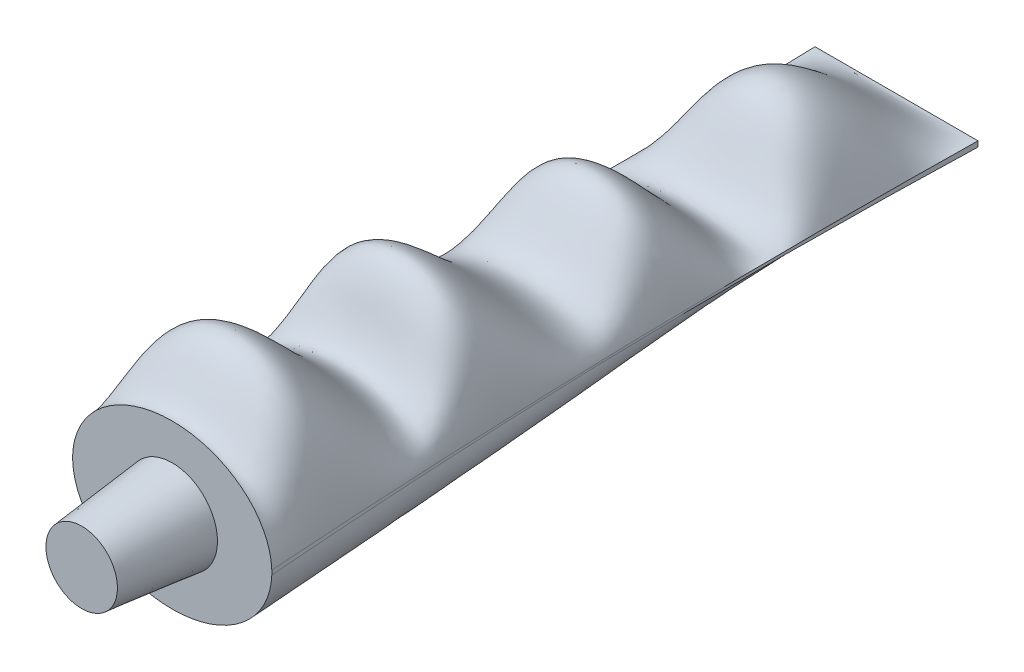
ISO-10303-21;
HEADER;
FILE_DESCRIPTION(('STEP AP214'),'2;1');
FILE_NAME('part.step','',(''),(''),'','','');
FILE_SCHEMA(('AUTOMOTIVE_DESIGN { 1 0 10303 214 1 1 1 1 }'));
ENDSEC;
DATA;
#1=APPLICATION_CONTEXT('core data for automotive mechanical design processes');
#2=APPLICATION_PROTOCOL_DEFINITION('international standard','automotive_design',2000,#1);
#3=PRODUCT_CONTEXT('',#1,'mechanical');
#4=PRODUCT('Part','Part','',(#3));
#5=PRODUCT_RELATED_PRODUCT_CATEGORY('part','',(#4));
#6=PRODUCT_DEFINITION_FORMATION('','',#4);
#7=PRODUCT_DEFINITION_CONTEXT('part definition',#1,'design');
#8=PRODUCT_DEFINITION('design','',#6,#7);
#9=PRODUCT_DEFINITION_SHAPE('','',#8);
#10=(LENGTH_UNIT() NAMED_UNIT(*) SI_UNIT(.MILLI.,.METRE.));
#11=(NAMED_UNIT(*) PLANE_ANGLE_UNIT() SI_UNIT($,.RADIAN.));
#12=(NAMED_UNIT(*) SI_UNIT($,.STERADIAN.) SOLID_ANGLE_UNIT());
#13=UNCERTAINTY_MEASURE_WITH_UNIT(LENGTH_MEASURE(1.E-05),#10,'distance_accuracy_value','');
#14=(GEOMETRIC_REPRESENTATION_CONTEXT(3) GLOBAL_UNCERTAINTY_ASSIGNED_CONTEXT((#13)) GLOBAL_UNIT_ASSIGNED_CONTEXT((#10,
#11,#12)) REPRESENTATION_CONTEXT('',''));
#15=CARTESIAN_POINT('',(0.,0.,0.));
#16=DIRECTION('',(0.,0.,1.));
#17=DIRECTION('',(1.,0.,0.));
#18=AXIS2_PLACEMENT_3D('',#15,#16,#17);
#19=CARTESIAN_POINT('',(0.,0.,400.));
#20=DIRECTION('',(0.,0.,1.));
#21=DIRECTION('',(1.,0.,0.));
#22=AXIS2_PLACEMENT_3D('',#19,#20,#21);
#23=PLANE('',#22);
#24=CARTESIAN_POINT('',(0.,0.,400.));
#25=DIRECTION('',(0.,0.,1.));
#26=DIRECTION('',(1.,0.,0.));
#27=AXIS2_PLACEMENT_3D('',#24,#25,#26);
#28=ELLIPSE('',#27,55.,45.);
#29=CARTESIAN_POINT('',(-54.9795568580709,1.22681655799,400.));
#30=VERTEX_POINT('',#29);
#31=CARTESIAN_POINT('',(-54.9795568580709,-1.22681655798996,400.));
#32=VERTEX_POINT('',#31);
#33=EDGE_CURVE('E167',#30,#32,#28,.T.);
#34=ORIENTED_EDGE('',*,*,#33,.T.);
#35=CARTESIAN_POINT('',(54.9795568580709,-1.22681655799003,400.));
#36=VERTEX_POINT('',#35);
#37=EDGE_CURVE('E175',#32,#36,#28,.T.);
#38=ORIENTED_EDGE('',*,*,#37,.T.);
#39=CARTESIAN_POINT('',(54.9795568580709,1.22681655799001,400.));
#40=VERTEX_POINT('',#39);
#41=EDGE_CURVE('E181',#36,#40,#28,.T.);
#42=ORIENTED_EDGE('',*,*,#41,.T.);
#43=CARTESIAN_POINT('',(0.,0.,400.));
#44=DIRECTION('',(0.,0.,1.));
#45=DIRECTION('',(1.,0.,0.));
#46=AXIS2_PLACEMENT_3D('',#43,#44,#45);
#47=ELLIPSE('',#46,55.,45.);
#48=EDGE_CURVE('E151',#40,#30,#47,.T.);
#49=ORIENTED_EDGE('',*,*,#48,.T.);
#50=EDGE_LOOP('',(#34,#38,#42,#49));
#51=FACE_BOUND('',#50,.T.);
#52=CARTESIAN_POINT('',(0.,0.,400.));
#53=DIRECTION('',(0.,0.,1.));
#54=DIRECTION('',(1.,0.,0.));
#55=AXIS2_PLACEMENT_3D('',#52,#53,#54);
#56=CIRCLE('',#55,25.);
#57=CARTESIAN_POINT('',(25.,0.,400.));
#58=VERTEX_POINT('',#57);
#59=EDGE_CURVE('E355',#58,#58,#56,.T.);
#60=ORIENTED_EDGE('',*,*,#59,.F.);
#61=EDGE_LOOP('',(#60));
#62=FACE_BOUND('',#61,.T.);
#63=ADVANCED_FACE('F104',(#51,#62),#23,.T.);
#64=CARTESIAN_POINT('',(-45.,1.5,0.));
#65=DIRECTION('',(0.,0.,-1.));
#66=DIRECTION('',(-1.,0.,0.));
#67=AXIS2_PLACEMENT_3D('',#64,#65,#66);
#68=PLANE('',#67);
#69=DIRECTION('',(0.,-1.,0.));
#70=VECTOR('',#69,1.);
#71=CARTESIAN_POINT('',(-45.,-1.5,0.));
#72=LINE('',#71,#70);
#73=CARTESIAN_POINT('',(-45.,1.5,0.));
#74=VERTEX_POINT('',#73);
#75=CARTESIAN_POINT('',(-45.,-1.5,0.));
#76=VERTEX_POINT('',#75);
#77=EDGE_CURVE('E161',#74,#76,#72,.T.);
#78=ORIENTED_EDGE('',*,*,#77,.F.);
#79=DIRECTION('',(-1.,0.,0.));
#80=VECTOR('',#79,1.);
#81=CARTESIAN_POINT('',(-45.,1.5,0.));
#82=LINE('',#81,#80);
#83=CARTESIAN_POINT('',(45.,1.5,0.));
#84=VERTEX_POINT('',#83);
#85=EDGE_CURVE('E155',#84,#74,#82,.T.);
#86=ORIENTED_EDGE('',*,*,#85,.F.);
#87=DIRECTION('',(0.,1.,0.));
#88=VECTOR('',#87,1.);
#89=CARTESIAN_POINT('',(45.,-1.5,0.));
#90=LINE('',#89,#88);
#91=CARTESIAN_POINT('',(45.,-1.5,0.));
#92=VERTEX_POINT('',#91);
#93=EDGE_CURVE('E117',#92,#84,#90,.T.);
#94=ORIENTED_EDGE('',*,*,#93,.F.);
#95=DIRECTION('',(1.,0.,0.));
#96=VECTOR('',#95,1.);
#97=CARTESIAN_POINT('',(-45.,-1.5,0.));
#98=LINE('',#97,#96);
#99=EDGE_CURVE('E13',#76,#92,#98,.T.);
#100=ORIENTED_EDGE('',*,*,#99,.F.);
#101=EDGE_LOOP('',(#78,#86,#94,#100));
#102=FACE_BOUND('',#101,.T.);
#103=ADVANCED_FACE('F201',(#102),#68,.T.);
#104=CARTESIAN_POINT('',(45.,1.5,0.));
#105=CARTESIAN_POINT('',(44.5257285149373,1.3387278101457,18.9597535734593));
#106=CARTESIAN_POINT('',(43.883941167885,1.06472996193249,56.7668056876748));
#107=CARTESIAN_POINT('',(43.7738494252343,0.77265733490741,116.652238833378));
#108=CARTESIAN_POINT('',(44.151467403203,0.631903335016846,160.20523461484));
#109=CARTESIAN_POINT('',(44.7278972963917,0.585629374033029,189.954312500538));
#110=CARTESIAN_POINT('',(45.6225712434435,0.567310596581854,224.46966044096));
#111=CARTESIAN_POINT('',(47.0389571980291,0.607968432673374,263.933587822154));
#112=CARTESIAN_POINT('',(49.6172948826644,0.768219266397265,316.981207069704));
#113=CARTESIAN_POINT('',(52.3603819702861,0.98527120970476,363.272878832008));
#114=CARTESIAN_POINT('',(54.1624664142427,1.14889598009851,389.10175257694));
#115=CARTESIAN_POINT('',(54.9795568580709,1.22681655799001,400.));
#116=CARTESIAN_POINT('',(31.2242080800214,1.5,0.));
#117=CARTESIAN_POINT('',(30.8951247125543,2.76986563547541,18.93214407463));
#118=CARTESIAN_POINT('',(38.3966789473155,56.6081248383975,73.0059575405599));
#119=CARTESIAN_POINT('',(35.2142086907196,-19.2656611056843,110.677011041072));
#120=CARTESIAN_POINT('',(45.1682127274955,47.4070945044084,169.353034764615));
#121=CARTESIAN_POINT('',(43.8905074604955,14.3562372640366,191.053282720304));
#122=CARTESIAN_POINT('',(44.9067955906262,3.46172991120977,223.653652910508));
#123=CARTESIAN_POINT('',(52.8879761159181,63.3767468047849,279.973675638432));
#124=CARTESIAN_POINT('',(47.3994289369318,-13.1392351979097,302.741409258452));
#125=CARTESIAN_POINT('',(56.8141996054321,64.5854880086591,372.925738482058));
#126=CARTESIAN_POINT('',(53.6671516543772,23.2400647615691,389.085862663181));
#127=CARTESIAN_POINT('',(54.2341072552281,23.5903046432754,400.));
#128=CARTESIAN_POINT('',(16.2242080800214,1.5,0.));
#129=CARTESIAN_POINT('',(16.0532152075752,4.32818384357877,18.9020810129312));
#130=CARTESIAN_POINT('',(26.2903299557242,91.0433387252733,82.5517735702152));
#131=CARTESIAN_POINT('',(17.0718183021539,-28.1663951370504,107.150194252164));
#132=CARTESIAN_POINT('',(29.7405840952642,78.576304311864,174.738073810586));
#133=CARTESIAN_POINT('',(25.7152551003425,26.5320438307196,191.700567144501));
#134=CARTESIAN_POINT('',(25.2094353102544,9.71965241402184,223.172879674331));
#135=CARTESIAN_POINT('',(35.7979289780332,105.404713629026,289.414091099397));
#136=CARTESIAN_POINT('',(24.6811817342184,-15.6344458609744,294.342590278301));
#137=CARTESIAN_POINT('',(37.6811282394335,108.256433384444,378.593944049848));
#138=CARTESIAN_POINT('',(31.4695722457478,42.7681093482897,389.068560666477));
#139=CARTESIAN_POINT('',(31.7641643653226,43.4148686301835,400.));
#140=CARTESIAN_POINT('',(1.22420808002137,1.5,0.));
#141=CARTESIAN_POINT('',(1.2113057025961,4.4553642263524,18.8996274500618));
#142=CARTESIAN_POINT('',(10.1541029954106,93.6648382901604,83.2718329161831));
#143=CARTESIAN_POINT('',(-2.82477738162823,-28.799125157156,106.883965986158));
#144=CARTESIAN_POINT('',(7.67785751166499,80.9768100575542,175.144381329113));
#145=CARTESIAN_POINT('',(2.03550267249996,27.5053163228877,191.74941025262));
#146=CARTESIAN_POINT('',(-0.00504971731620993,10.2529148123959,223.136599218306));
#147=CARTESIAN_POINT('',(9.5273097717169,108.64389464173,290.126355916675));
#148=CARTESIAN_POINT('',(-3.18377684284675,-15.7463557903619,293.708671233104));
#149=CARTESIAN_POINT('',(9.30561303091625,111.635054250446,379.021427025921));
#150=CARTESIAN_POINT('',(2.40767941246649,44.3290406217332,389.067148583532));
#151=CARTESIAN_POINT('',(2.42990805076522,45.,400.));
#152=CARTESIAN_POINT('',(-15.,1.5,0.));
#153=CARTESIAN_POINT('',(-14.8419095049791,4.4553642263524,18.8996274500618));
#154=CARTESIAN_POINT('',(-7.63403959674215,93.6648382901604,83.2718329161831));
#155=CARTESIAN_POINT('',(-24.4384678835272,-28.799125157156,106.883965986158));
#156=CARTESIAN_POINT('',(-16.6820186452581,80.9768100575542,175.144381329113));
#157=CARTESIAN_POINT('',(-23.9584741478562,27.5053163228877,191.74941025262));
#158=CARTESIAN_POINT('',(-27.6460954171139,10.2529148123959,223.136599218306));
#159=CARTESIAN_POINT('',(-19.5694063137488,108.64389464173,290.126355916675));
#160=CARTESIAN_POINT('',(-33.6441745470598,-15.7463557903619,293.708671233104));
#161=CARTESIAN_POINT('',(-22.0692603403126,111.635054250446,379.021427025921));
#162=CARTESIAN_POINT('',(-29.5008600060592,44.3290406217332,389.067148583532));
#163=CARTESIAN_POINT('',(-29.7732234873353,45.,400.));
#164=CARTESIAN_POINT('',(-30.,1.5,0.));
#165=CARTESIAN_POINT('',(-29.6838190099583,2.89704601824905,18.9296905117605));
#166=CARTESIAN_POINT('',(-26.1598615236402,61.5440786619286,74.4490760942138));
#167=CARTESIAN_POINT('',(-40.3944121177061,-21.0463987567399,110.146012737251));
#168=CARTESIAN_POINT('',(-37.4722109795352,51.5638476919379,170.165968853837));
#169=CARTESIAN_POINT('',(-43.7172775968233,15.5799846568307,191.150944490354));
#170=CARTESIAN_POINT('',(-47.630817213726,3.71894717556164,223.581137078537));
#171=CARTESIAN_POINT('',(-43.6320275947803,68.9547960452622,281.399104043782));
#172=CARTESIAN_POINT('',(-54.5119157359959,-14.3751436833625,301.475966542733));
#173=CARTESIAN_POINT('',(-47.9590596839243,70.2374243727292,373.783555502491));
#174=CARTESIAN_POINT('',(-53.6231347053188,25.2032322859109,389.084450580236));
#175=CARTESIAN_POINT('',(-54.1678616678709,25.57767226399,400.));
#176=CARTESIAN_POINT('',(-45.,1.5,0.));
#177=CARTESIAN_POINT('',(-44.5257285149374,1.3387278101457,18.9597535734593));
#178=CARTESIAN_POINT('',(-43.883941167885,1.06472996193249,56.7668056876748));
#179=CARTESIAN_POINT('',(-43.7738494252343,0.772657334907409,116.652238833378));
#180=CARTESIAN_POINT('',(-44.151467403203,0.631903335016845,160.20523461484));
#181=CARTESIAN_POINT('',(-44.7278972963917,0.585629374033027,189.954312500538));
#182=CARTESIAN_POINT('',(-45.6225712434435,0.56731059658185,224.46966044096));
#183=CARTESIAN_POINT('',(-47.0389571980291,0.607968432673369,263.933587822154));
#184=CARTESIAN_POINT('',(-49.6172948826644,0.768219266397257,316.981207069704));
#185=CARTESIAN_POINT('',(-52.3603819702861,0.985271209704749,363.272878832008));
#186=CARTESIAN_POINT('',(-54.1624664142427,1.14889598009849,389.10175257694));
#187=CARTESIAN_POINT('',(-54.9795568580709,1.22681655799,400.));
#188=B_SPLINE_SURFACE_WITH_KNOTS('',3,3,((#104,#105,#106,#107,#108,#109,#110,#111,#112,#113,
#114,#115),(#116,#117,#118,#119,#120,#121,#122,#123,#124,#125,#126,#127),(#128,#129,#130,#131,
#132,#133,#134,#135,#136,#137,#138,#139),(#140,#141,#142,#143,#144,#145,#146,#147,#148,#149,
#150,#151),(#152,#153,#154,#155,#156,#157,#158,#159,#160,#161,#162,#163),(#164,#165,#166,#167,
#168,#169,#170,#171,#172,#173,#174,#175),(#176,#177,#178,#179,#180,#181,#182,#183,#184,#185,
#186,#187)),.UNSPECIFIED.,.F.,.F.,.F.,(4,1,2,4),(4,1,1,1,1,1,1,1,1,4),(0.,0.459193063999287,0.5,
1.),(0.,0.213202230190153,0.322346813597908,0.421985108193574,0.500087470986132,
0.513611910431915,0.643865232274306,0.754579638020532,0.877340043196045,1.),.UNSPECIFIED.);
#189=CARTESIAN_POINT('',(-45.,1.5,0.));
#190=CARTESIAN_POINT('',(-43.8875480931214,1.12171970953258,44.472026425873));
#191=CARTESIAN_POINT('',(-42.2108032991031,0.145787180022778,199.917991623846));
#192=CARTESIAN_POINT('',(-51.6494256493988,0.909243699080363,355.583137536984));
#193=CARTESIAN_POINT('',(-54.9795568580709,1.22681655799,400.));
#194=B_SPLINE_CURVE_WITH_KNOTS('',3,(#189,#190,#191,#192,#193),.UNSPECIFIED.,.F.,.F.,(4,1,4),
(0.,0.500087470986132,1.),.UNSPECIFIED.);
#195=EDGE_CURVE('E146',#74,#30,#194,.T.);
#196=CARTESIAN_POINT('',(54.9795568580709,1.22681655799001,400.));
#197=CARTESIAN_POINT('',(51.6494256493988,0.909243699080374,355.583137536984));
#198=CARTESIAN_POINT('',(42.2108032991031,0.145787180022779,199.917991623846));
#199=CARTESIAN_POINT('',(43.8875480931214,1.12171970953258,44.472026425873));
#200=CARTESIAN_POINT('',(45.,1.5,0.));
#201=B_SPLINE_CURVE_WITH_KNOTS('',3,(#196,#197,#198,#199,#200),.UNSPECIFIED.,.F.,.F.,(4,1,4),
(0.,0.499912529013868,1.),.UNSPECIFIED.);
#202=EDGE_CURVE('E162',#40,#84,#201,.T.);
#203=ORIENTED_EDGE('',*,*,#85,.T.);
#204=ORIENTED_EDGE('',*,*,#195,.T.);
#205=ORIENTED_EDGE('',*,*,#48,.F.);
#206=ORIENTED_EDGE('',*,*,#202,.T.);
#207=EDGE_LOOP('',(#203,#204,#205,#206));
#208=FACE_BOUND('',#207,.T.);
#209=ADVANCED_FACE('F106',(#208),#188,.T.);
#210=CARTESIAN_POINT('',(-45.,1.5,0.));
#211=CARTESIAN_POINT('',(-43.8875480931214,1.12171970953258,44.472026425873));
#212=CARTESIAN_POINT('',(-42.2108032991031,0.145787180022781,199.917991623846));
#213=CARTESIAN_POINT('',(-51.6494256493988,0.909243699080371,355.583137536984));
#214=CARTESIAN_POINT('',(-54.9795568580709,1.22681655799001,400.));
#215=CARTESIAN_POINT('',(-45.,0.499999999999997,0.));
#216=CARTESIAN_POINT('',(-43.8875480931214,0.373906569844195,44.472026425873));
#217=CARTESIAN_POINT('',(-42.2230664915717,0.0457725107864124,199.917991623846));
#218=CARTESIAN_POINT('',(-51.6767767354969,0.3004263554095,355.583137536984));
#219=CARTESIAN_POINT('',(-55.006907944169,0.406283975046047,400.));
#220=CARTESIAN_POINT('',(-45.,-0.500000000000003,0.));
#221=CARTESIAN_POINT('',(-43.8875480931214,-0.373906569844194,44.472026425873));
#222=CARTESIAN_POINT('',(-42.2230664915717,-0.0457725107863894,199.917991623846));
#223=CARTESIAN_POINT('',(-51.6767767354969,-0.300426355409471,355.583137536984));
#224=CARTESIAN_POINT('',(-55.006907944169,-0.406283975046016,400.));
#225=CARTESIAN_POINT('',(-45.,-1.5,0.));
#226=CARTESIAN_POINT('',(-43.8875480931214,-1.12171970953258,44.472026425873));
#227=CARTESIAN_POINT('',(-42.2108032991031,-0.145787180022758,199.917991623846));
#228=CARTESIAN_POINT('',(-51.6494256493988,-0.909243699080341,355.583137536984));
#229=CARTESIAN_POINT('',(-54.9795568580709,-1.22681655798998,400.));
#230=B_SPLINE_SURFACE_WITH_KNOTS('',3,3,((#210,#211,#212,#213,#214),(#215,#216,#217,#218,#219),
(#220,#221,#222,#223,#224),(#225,#226,#227,#228,#229)),.UNSPECIFIED.,.F.,.F.,.F.,(4,4),(4,1,4),
(0.,1.),(0.,0.500087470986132,1.),.UNSPECIFIED.);
#231=CARTESIAN_POINT('',(-45.,-1.5,0.));
#232=CARTESIAN_POINT('',(-43.8875480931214,-1.12171970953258,44.472026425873));
#233=CARTESIAN_POINT('',(-42.2108032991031,-0.145787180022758,199.917991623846));
#234=CARTESIAN_POINT('',(-51.6494256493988,-0.909243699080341,355.583137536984));
#235=CARTESIAN_POINT('',(-54.9795568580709,-1.22681655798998,400.));
#236=B_SPLINE_CURVE_WITH_KNOTS('',3,(#231,#232,#233,#234,#235),.UNSPECIFIED.,.F.,.F.,(4,1,4),
(0.,0.500087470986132,1.),.UNSPECIFIED.);
#237=EDGE_CURVE('E171',#76,#32,#236,.T.);
#238=ORIENTED_EDGE('',*,*,#77,.T.);
#239=ORIENTED_EDGE('',*,*,#237,.T.);
#240=ORIENTED_EDGE('',*,*,#33,.F.);
#241=ORIENTED_EDGE('',*,*,#195,.F.);
#242=EDGE_LOOP('',(#238,#239,#240,#241));
#243=FACE_BOUND('',#242,.T.);
#244=ADVANCED_FACE('F169',(#243),#230,.T.);
#245=CARTESIAN_POINT('',(45.,-1.5,0.));
#246=CARTESIAN_POINT('',(43.8875480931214,-1.12171970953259,44.472026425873));
#247=CARTESIAN_POINT('',(42.2108032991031,-0.145787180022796,199.917991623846));
#248=CARTESIAN_POINT('',(51.6494256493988,-0.909243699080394,355.583137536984));
#249=CARTESIAN_POINT('',(54.9795568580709,-1.22681655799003,400.));
#250=CARTESIAN_POINT('',(45.,-0.500000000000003,0.));
#251=CARTESIAN_POINT('',(43.8875480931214,-0.3739065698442,44.472026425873));
#252=CARTESIAN_POINT('',(42.2230664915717,-0.0457725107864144,199.917991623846));
#253=CARTESIAN_POINT('',(51.6767767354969,-0.300426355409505,355.583137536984));
#254=CARTESIAN_POINT('',(55.006907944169,-0.406283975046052,400.));
#255=CARTESIAN_POINT('',(45.,0.499999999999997,0.));
#256=CARTESIAN_POINT('',(43.8875480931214,0.373906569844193,44.472026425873));
#257=CARTESIAN_POINT('',(42.2230664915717,0.0457725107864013,199.917991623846));
#258=CARTESIAN_POINT('',(51.6767767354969,0.300426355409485,355.583137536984));
#259=CARTESIAN_POINT('',(55.006907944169,0.40628397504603,400.));
#260=CARTESIAN_POINT('',(45.,1.5,0.));
#261=CARTESIAN_POINT('',(43.8875480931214,1.12171970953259,44.472026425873));
#262=CARTESIAN_POINT('',(42.2108032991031,0.145787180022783,199.917991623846));
#263=CARTESIAN_POINT('',(51.6494256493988,0.909243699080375,355.583137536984));
#264=CARTESIAN_POINT('',(54.9795568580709,1.22681655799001,400.));
#265=B_SPLINE_SURFACE_WITH_KNOTS('',3,3,((#245,#246,#247,#248,#249),(#250,#251,#252,#253,#254),
(#255,#256,#257,#258,#259),(#260,#261,#262,#263,#264)),.UNSPECIFIED.,.F.,.F.,.F.,(4,4),(4,1,4),
(0.,1.),(0.,0.500087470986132,1.),.UNSPECIFIED.);
#266=CARTESIAN_POINT('',(45.,-1.5,0.));
#267=CARTESIAN_POINT('',(43.8875480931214,-1.12171970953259,44.472026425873));
#268=CARTESIAN_POINT('',(42.2108032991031,-0.145787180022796,199.917991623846));
#269=CARTESIAN_POINT('',(51.6494256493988,-0.909243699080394,355.583137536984));
#270=CARTESIAN_POINT('',(54.9795568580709,-1.22681655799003,400.));
#271=B_SPLINE_CURVE_WITH_KNOTS('',3,(#266,#267,#268,#269,#270),.UNSPECIFIED.,.F.,.F.,(4,1,4),
(0.,0.500087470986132,1.),.UNSPECIFIED.);
#272=EDGE_CURVE('E126',#92,#36,#271,.T.);
#273=ORIENTED_EDGE('',*,*,#93,.T.);
#274=ORIENTED_EDGE('',*,*,#202,.F.);
#275=ORIENTED_EDGE('',*,*,#41,.F.);
#276=ORIENTED_EDGE('',*,*,#272,.F.);
#277=EDGE_LOOP('',(#273,#274,#275,#276));
#278=FACE_BOUND('',#277,.T.);
#279=ADVANCED_FACE('F240',(#278),#265,.T.);
#280=CARTESIAN_POINT('',(-45.,-1.5,0.));
#281=CARTESIAN_POINT('',(-43.8875480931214,-1.12171970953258,44.472026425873));
#282=CARTESIAN_POINT('',(-42.2108032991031,-0.145787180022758,199.917991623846));
#283=CARTESIAN_POINT('',(-51.6494256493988,-0.909243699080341,355.583137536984));
#284=CARTESIAN_POINT('',(-54.9795568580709,-1.22681655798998,400.));
#285=CARTESIAN_POINT('',(-30.,-1.5,0.));
#286=CARTESIAN_POINT('',(-29.2583653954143,-4.77691323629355,44.401510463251));
#287=CARTESIAN_POINT('',(-48.3586213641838,-17.1932393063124,199.988507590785));
#288=CARTESIAN_POINT('',(-51.9477741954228,-24.0516058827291,355.512621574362));
#289=CARTESIAN_POINT('',(-54.1678616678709,-25.57767226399,400.));
#290=CARTESIAN_POINT('',(-15.,-1.5,0.));
#291=CARTESIAN_POINT('',(-14.6291826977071,-8.43210676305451,44.3309945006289));
#292=CARTESIAN_POINT('',(-27.2988082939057,-30.645307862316,200.059023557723));
#293=CARTESIAN_POINT('',(-28.6631797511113,-42.2654400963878,355.44210561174));
#294=CARTESIAN_POINT('',(-29.7732234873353,-45.,400.));
#295=CARTESIAN_POINT('',(15.,-1.5,0.));
#296=CARTESIAN_POINT('',(14.6291826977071,-8.43210676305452,44.3309945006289));
#297=CARTESIAN_POINT('',(27.2988082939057,-30.6453078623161,200.059023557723));
#298=CARTESIAN_POINT('',(28.6631797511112,-42.2654400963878,355.44210561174));
#299=CARTESIAN_POINT('',(29.7732234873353,-45.,400.));
#300=CARTESIAN_POINT('',(30.,-1.5,0.));
#301=CARTESIAN_POINT('',(29.2583653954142,-4.77691323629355,44.401510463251));
#302=CARTESIAN_POINT('',(48.3586213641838,-17.1932393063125,199.988507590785));
#303=CARTESIAN_POINT('',(51.9477741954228,-24.0516058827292,355.512621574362));
#304=CARTESIAN_POINT('',(54.1678616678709,-25.5776722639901,400.));
#305=CARTESIAN_POINT('',(45.,-1.5,0.));
#306=CARTESIAN_POINT('',(43.8875480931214,-1.12171970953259,44.472026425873));
#307=CARTESIAN_POINT('',(42.2108032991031,-0.145787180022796,199.917991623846));
#308=CARTESIAN_POINT('',(51.6494256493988,-0.909243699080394,355.583137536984));
#309=CARTESIAN_POINT('',(54.9795568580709,-1.22681655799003,400.));
#310=B_SPLINE_SURFACE_WITH_KNOTS('',3,3,((#280,#281,#282,#283,#284),(#285,#286,#287,#288,#289),
(#290,#291,#292,#293,#294),(#295,#296,#297,#298,#299),(#300,#301,#302,#303,#304),(#305,#306,
#307,#308,#309)),.UNSPECIFIED.,.F.,.F.,.F.,(4,2,4),(4,1,4),(0.,0.5,1.),(0.,0.500087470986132,
1.),.UNSPECIFIED.);
#311=ORIENTED_EDGE('',*,*,#99,.T.);
#312=ORIENTED_EDGE('',*,*,#272,.T.);
#313=ORIENTED_EDGE('',*,*,#37,.F.);
#314=ORIENTED_EDGE('',*,*,#237,.F.);
#315=EDGE_LOOP('',(#311,#312,#313,#314));
#316=FACE_BOUND('',#315,.T.);
#317=ADVANCED_FACE('F202',(#316),#310,.T.);
#318=CARTESIAN_POINT('',(0.,0.,400.));
#319=DIRECTION('',(0.,0.,-1.));
#320=DIRECTION('',(1.,0.,0.));
#321=AXIS2_PLACEMENT_3D('',#318,#319,#320);
#322=CONICAL_SURFACE('',#321,25.,0.10471975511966);
#323=CARTESIAN_POINT('',(0.,0.,450.));
#324=DIRECTION('',(0.,0.,1.));
#325=DIRECTION('',(1.,0.,0.));
#326=AXIS2_PLACEMENT_3D('',#323,#324,#325);
#327=CIRCLE('',#326,19.7447882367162);
#328=CARTESIAN_POINT('',(19.7447882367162,0.,450.));
#329=VERTEX_POINT('',#328);
#330=EDGE_CURVE('E183',#329,#329,#327,.T.);
#331=ORIENTED_EDGE('',*,*,#330,.F.);
#332=EDGE_LOOP('',(#331));
#333=FACE_BOUND('',#332,.T.);
#334=ORIENTED_EDGE('',*,*,#59,.T.);
#335=EDGE_LOOP('',(#334));
#336=FACE_BOUND('',#335,.T.);
#337=ADVANCED_FACE('F325',(#333,#336),#322,.T.);
#338=CARTESIAN_POINT('',(0.,0.,450.));
#339=DIRECTION('',(0.,0.,1.));
#340=DIRECTION('',(1.,0.,0.));
#341=AXIS2_PLACEMENT_3D('',#338,#339,#340);
#342=PLANE('',#341);
#343=ORIENTED_EDGE('',*,*,#330,.T.);
#344=EDGE_LOOP('',(#343));
#345=FACE_BOUND('',#344,.T.);
#346=ADVANCED_FACE('F347',(#345),#342,.T.);
#347=CLOSED_SHELL('',(#63,#103,#209,#244,#279,#317,#337,#346));
#348=MANIFOLD_SOLID_BREP('B2',#347);
#349=ADVANCED_BREP_SHAPE_REPRESENTATION('',(#18,#348),#14);
#350=SHAPE_DEFINITION_REPRESENTATION(#9,#349);
ENDSEC;
END-ISO-10303-21;
